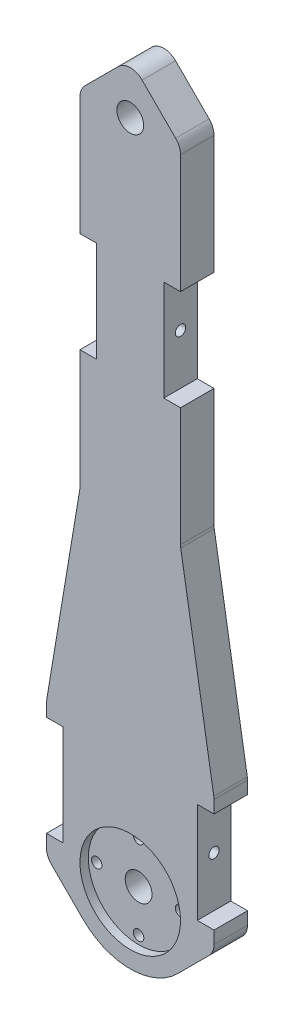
from build123d import *
from build123d.topology import SkipClean

# Parameters (mm, degrees)
SALIENTE_EXTRUIR1_DEPTH     = 10
CROQUIS2_R                  = 1.55
SALIENTE_EXTRUIR2_DEPTH     = 4
CORTAR_EXTRUIR1_START       = 2
CORTAR_EXTRUIR1_DEPTH       = 2
REDONDEO1_R                 = 2
SALIENTE_EXTRUIR3_DEPTH     = 4
CROQUIS7_R                  = 15
CORTAR_EXTRUIR3_DEPTH       = 215.540742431
SALIENTE_EXTRUIR4_START     = -4
SALIENTE_EXTRUIR4_DEPTH     = 4
SALIENTE_EXTRUIR5_START     = -2
SALIENTE_EXTRUIR5_DEPTH     = 2
CROQUIS4_R                  = 1.55
CORTAR_EXTRUIR2_DEPTH       = 215.540742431
CROQUIS10_R                 = 4
CORTAR_EXTRUIR4_DEPTH       = 215.540742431
CROQUIS11_R                 = 2.875
CORTAR_EXTRUIR5_DEPTH       = 3.3
CROQUIS12_R                 = 4
CORTAR_EXTRUIR6_DEPTH       = 215.62462618
CROQUIS16_R                 = 1.55
CORTAR_EXTRUIR10_DEPTH      = 217.017893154
CORTAR_EXTRUIR11_DEPTH      = 218.861722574
CORTAR_EXTRUIR11_DEPTH_BACK = 218.861722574
CROQUIS17_R                 = 1.55
CORTAR_EXTRUIR13_START      = -0.5
CROQUIS19_R                 = 15
CORTAR_EXTRUIR13_DEPTH      = 0.5


with BuildPart() as part:
    # Croquis1 → Saliente-Extruir1 (new body)
    with BuildSketch(Plane.XY):
        with BuildLine():
            Line((20, 32.544356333), (25, 32.544356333))
            Line((25, 32.544356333), (25, 36.301916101))
            ThreePointArc((25, 36.301916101), (24.98296338, 36.714318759), (24.931969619, 37.123911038))
            Line((24.931969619, 37.123911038), (15.068030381, 96.307546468))
            ThreePointArc((15.068030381, 96.307546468), (15.01703662, 96.717138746), (15, 97.129541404))
            Line((15, 97.129541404), (15, 132.529236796))
            Line((15, 132.529236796), (10, 132.529236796))
            Line((10, 132.529236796), (10, 162.529236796))
            Line((10, 162.529236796), (15, 162.529236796))
            Line((15, 162.529236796), (15, 197.928932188))
            ThreePointArc((15, 197.928932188), (14.619397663, 199.84234935), (13.535533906, 201.464466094))
            Line((13.535533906, 201.464466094), (3.535533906, 211.464466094))
            ThreePointArc((3.535533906, 211.464466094), (0, 212.928932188), (-3.535533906, 211.464466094))
            Line((-3.535533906, 211.464466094), (-13.535533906, 201.464466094))
            ThreePointArc((-13.535533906, 201.464466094), (-14.619397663, 199.84234935), (-15, 197.928932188))
            Line((-15, 197.928932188), (-15, 162.529236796))
            Line((-15, 162.529236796), (-10, 162.529236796))
            Line((-10, 162.529236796), (-10, 132.529236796))
            Line((-10, 132.529236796), (-15, 132.529236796))
            Line((-15, 132.529236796), (-15, 97.129541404))
            ThreePointArc((-15, 97.129541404), (-15.01703662, 96.717138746), (-15.068030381, 96.307546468))
            Line((-15.068030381, 96.307546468), (-24.931969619, 37.123911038))
            ThreePointArc((-24.931969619, 37.123911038), (-24.98296338, 36.714318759), (-25, 36.301916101))
            Line((-25, 36.301916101), (-25, 32.544356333))
            Line((-25, 32.544356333), (-20, 32.544356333))
            Line((-20, 32.544356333), (-20, 2.544356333))
            Line((-20, 2.544356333), (-25, 2.544356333))
            Line((-25, 2.544356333), (-25, -1.213203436))
            ThreePointArc((-25, -1.213203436), (-24.619397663, -3.126620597), (-23.535533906, -4.748737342))
            Line((-23.535533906, -4.748737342), (-14.142135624, -14.142135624))
            ThreePointArc((-14.142135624, -14.142135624), (0, -20), (14.142135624, -14.142135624))
            Line((14.142135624, -14.142135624), (23.535533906, -4.748737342))
            ThreePointArc((23.535533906, -4.748737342), (24.619397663, -3.126620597), (25, -1.213203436))
            Line((25, -1.213203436), (25, 2.544356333))
            Line((25, 2.544356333), (20, 2.544356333))
            Line((20, 2.544356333), (20, 32.544356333))
        make_face()
        with BuildLine():
            Line((-3.8, 10.35), (-3.8, 24.5))
            ThreePointArc((-3.8, 24.5), (-2.687005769, 27.187005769), (0, 28.3))
            ThreePointArc((0, 28.3), (2.687005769, 27.187005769), (3.8, 24.5))
            Line((3.8, 24.5), (3.8, 10.35))
            ThreePointArc((3.8, 10.35), (4.313167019, 7.18772234), (5.8, 4.35))
            ThreePointArc((5.8, 4.35), (6.484597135, -3.242298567), (0, -7.25))
            ThreePointArc((0, -7.25), (-6.484597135, -3.242298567), (-5.8, 4.35))
            ThreePointArc((-5.8, 4.35), (-4.313167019, 7.18772234), (-3.8, 10.35))
        make_face(mode=Mode.SUBTRACT)
    extrude(amount=SALIENTE_EXTRUIR1_DEPTH)

    # Croquis2 → Saliente-Extruir2 (add)
    with BuildSketch(Plane.XY):
        with BuildLine():
            Line((3.8, 10.35), (3.8, 24.5))
            ThreePointArc((3.8, 24.5), (0, 28.3), (-3.8, 24.5))
            Line((-3.8, 24.5), (-3.8, 10.35))
            ThreePointArc((-3.8, 10.35), (-4.313167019, 7.18772234), (-5.8, 4.35))
            ThreePointArc((-5.8, 4.35), (0, -7.25), (5.8, 4.35))
            ThreePointArc((5.8, 4.35), (4.313167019, 7.18772234), (3.8, 10.35))
        make_face()
        with Locations((0, 24.5)):
            Circle(CROQUIS2_R, mode=Mode.SUBTRACT)
        with Locations((0, 20.5)):
            Circle(CROQUIS2_R, mode=Mode.SUBTRACT)
        with BuildLine():
            ThreePointArc((1.8, 10.35), (0, 12.15), (-1.8, 10.35))
            ThreePointArc((-1.8, 10.35), (-2.415800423, 6.555266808), (-4.2, 3.15))
            ThreePointArc((-4.2, 3.15), (0, -5.25), (4.2, 3.15))
            ThreePointArc((4.2, 3.15), (2.415800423, 6.555266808), (1.8, 10.35))
        make_face(mode=Mode.SUBTRACT)
    extrude(amount=SALIENTE_EXTRUIR2_DEPTH)

    # Croquis3 → Cortar-Extruir1 (cut)
    with BuildSketch(Plane(origin=(0, 0, 10), x_dir=(-1, 0, 0), z_dir=(0, 0, -1)).offset(CORTAR_EXTRUIR1_START)):
        with BuildLine():
            Line((12, 9), (4.2, 3.15))
            ThreePointArc((4.2, 3.15), (0, -5.25), (-4.2, 3.15))
            Line((-4.2, 3.15), (-12, 9))
            ThreePointArc((-12, 9), (0, -15), (12, 9))
        make_face()
    extrude(amount=-CORTAR_EXTRUIR1_DEPTH, mode=Mode.SUBTRACT)

    # Redondeo1
    redondeo1_edges = [part.edges().sort_by_distance(p)[0] for p in [
        (12, 9, 9),
        (-12, 9, 9),
    ]]
    fillet(redondeo1_edges, radius=REDONDEO1_R)

    # Croquis6 → Saliente-Extruir3 (add)
    with BuildSketch(Plane(origin=(0, 0, 0), x_dir=(-1, 0, 0), z_dir=(0, 0, -1))):
        with BuildLine():
            Line((-3.8, 24.5), (-3.8, 10.35))
            ThreePointArc((-3.8, 10.35), (-4.313167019, 7.18772234), (-5.8, 4.35))
            ThreePointArc((-5.8, 4.35), (0, -7.25), (5.8, 4.35))
            ThreePointArc((5.8, 4.35), (4.313167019, 7.18772234), (3.8, 10.35))
            Line((3.8, 10.35), (3.8, 24.5))
            ThreePointArc((3.8, 24.5), (0, 28.3), (-3.8, 24.5))
        make_face()
    extrude(amount=-SALIENTE_EXTRUIR3_DEPTH)

    # Croquis7 → Cortar-Extruir3 (cut, through all)
    with BuildSketch(Plane.XY.offset(8)):
        Circle(CROQUIS7_R)
    extrude(amount=CORTAR_EXTRUIR3_DEPTH, mode=Mode.SUBTRACT)

    # Croquis8 → Saliente-Extruir4 (add)
    with BuildSketch(Plane.XY.offset(8).offset(SALIENTE_EXTRUIR4_START)):
        with BuildLine():
            Line((3.8, 10.35), (3.8, 14.510685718))
            Line((3.8, 14.510685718), (3.8, 24.5))
            ThreePointArc((3.8, 24.5), (0, 28.3), (-3.8, 24.5))
            Line((-3.8, 24.5), (-3.8, 14.510685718))
            Line((-3.8, 14.510685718), (-3.8, 10.35))
            ThreePointArc((-3.8, 10.35), (-4.313167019, 7.18772234), (-5.8, 4.35))
            ThreePointArc((-5.8, 4.35), (0, -7.25), (5.8, 4.35))
            ThreePointArc((5.8, 4.35), (4.313167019, 7.18772234), (3.8, 10.35))
        make_face()
    extrude(amount=SALIENTE_EXTRUIR4_DEPTH)

    # Croquis9 → Saliente-Extruir5 (add)
    with BuildSketch(Plane.XY.offset(10).offset(SALIENTE_EXTRUIR5_START)):
        with BuildLine():
            Line((3.8, 14.510685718), (3.8, 24.5))
            ThreePointArc((3.8, 24.5), (0, 28.3), (-3.8, 24.5))
            Line((-3.8, 24.5), (-3.8, 14.510685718))
            ThreePointArc((-3.8, 14.510685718), (0, 15), (3.8, 14.510685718))
        make_face()
    extrude(amount=SALIENTE_EXTRUIR5_DEPTH)

    # Croquis4 → Cortar-Extruir2 (cut, through all)
    with BuildSketch(Plane.XY.offset(8)):
        with Locations((-12.5, 0)):
            Circle(CROQUIS4_R)
        with Locations((0, -12.5)):
            Circle(CROQUIS4_R)
        with Locations((12.5, 0)):
            Circle(CROQUIS4_R)
        with Locations((0, 12.5)):
            Circle(CROQUIS4_R)
    extrude(amount=-CORTAR_EXTRUIR2_DEPTH, mode=Mode.SUBTRACT)

    # Croquis10 → Cortar-Extruir4 (cut, through all)
    with BuildSketch(Plane.XY.offset(8)):
        Circle(CROQUIS10_R)
    extrude(amount=-CORTAR_EXTRUIR4_DEPTH, mode=Mode.SUBTRACT)

    # Croquis11 → Cortar-Extruir5 (cut)
    with BuildSketch(Plane(origin=(0, 0, 0), x_dir=(-1, 0, 0), z_dir=(0, 0, -1))):
        with Locations((12.5, 0)):
            Circle(CROQUIS11_R)
        with Locations((0, -12.5)):
            Circle(CROQUIS11_R)
        with Locations((0, 12.5)):
            Circle(CROQUIS11_R)
        with Locations((-12.5, 0)):
            Circle(CROQUIS11_R)
    extrude(amount=-CORTAR_EXTRUIR5_DEPTH, mode=Mode.SUBTRACT)

    # Croquis12 → Cortar-Extruir6 (cut, through all)
    with BuildSketch(Plane.XY.offset(10)):
        with Locations((0, 200)):
            Circle(CROQUIS12_R)
    extrude(amount=-CORTAR_EXTRUIR6_DEPTH, mode=Mode.SUBTRACT)

    # Croquis16 → Cortar-Extruir10 (cut, through all)
    with BuildSketch(Plane(origin=(-10, 0, 0), x_dir=(0, 0, -1), z_dir=(1, 0, 0))):
        with Locations(Location((-5, 147.529236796, 0), (0, 0, 180))):
            Circle(CROQUIS16_R)
    extrude(amount=CORTAR_EXTRUIR10_DEPTH, mode=Mode.SUBTRACT)

    # Croquis17 → Cortar-Extruir11 (cut, two sides: drawn at the far end of the back side and taken through both)
    with BuildSketch(Plane(origin=(-20, 0, 0), x_dir=(0, 0, -1), z_dir=(1, 0, 0)).offset(-CORTAR_EXTRUIR11_DEPTH_BACK)):
        with Locations(Location((-5, 17.544356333, 0), (0, 0, 270))):
            Circle(CROQUIS17_R)
    extrude(amount=CORTAR_EXTRUIR11_DEPTH + CORTAR_EXTRUIR11_DEPTH_BACK, mode=Mode.SUBTRACT)

    # Croquis19 → Cortar-Extruir13 (cut)
    with SkipClean():  # the faces are left unmerged after this step: merging them gives an invalid solid
        with BuildSketch(Plane.XY.offset(8).offset(CORTAR_EXTRUIR13_START)):
            Circle(CROQUIS19_R)
        extrude(amount=CORTAR_EXTRUIR13_DEPTH, mode=Mode.SUBTRACT)


solid = part.part
